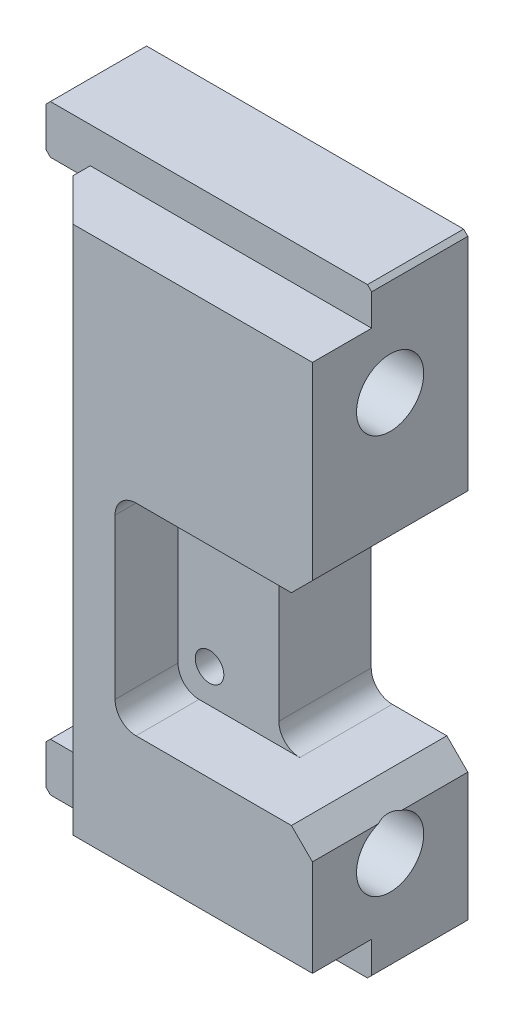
ISO-10303-21;
HEADER;
FILE_DESCRIPTION(('STEP AP214'),'2;1');
FILE_NAME('part.step','',(''),(''),'','','');
FILE_SCHEMA(('AUTOMOTIVE_DESIGN { 1 0 10303 214 1 1 1 1 }'));
ENDSEC;
DATA;
#1=APPLICATION_CONTEXT('core data for automotive mechanical design processes');
#2=APPLICATION_PROTOCOL_DEFINITION('international standard','automotive_design',2000,#1);
#3=PRODUCT_CONTEXT('',#1,'mechanical');
#4=PRODUCT('Part','Part','',(#3));
#5=PRODUCT_RELATED_PRODUCT_CATEGORY('part','',(#4));
#6=PRODUCT_DEFINITION_FORMATION('','',#4);
#7=PRODUCT_DEFINITION_CONTEXT('part definition',#1,'design');
#8=PRODUCT_DEFINITION('design','',#6,#7);
#9=PRODUCT_DEFINITION_SHAPE('','',#8);
#10=(LENGTH_UNIT() NAMED_UNIT(*) SI_UNIT(.MILLI.,.METRE.));
#11=(NAMED_UNIT(*) PLANE_ANGLE_UNIT() SI_UNIT($,.RADIAN.));
#12=(NAMED_UNIT(*) SI_UNIT($,.STERADIAN.) SOLID_ANGLE_UNIT());
#13=UNCERTAINTY_MEASURE_WITH_UNIT(LENGTH_MEASURE(1.E-05),#10,'distance_accuracy_value','');
#14=(GEOMETRIC_REPRESENTATION_CONTEXT(3) GLOBAL_UNCERTAINTY_ASSIGNED_CONTEXT((#13)) GLOBAL_UNIT_ASSIGNED_CONTEXT((#10,
#11,#12)) REPRESENTATION_CONTEXT('',''));
#15=CARTESIAN_POINT('',(0.,0.,0.));
#16=DIRECTION('',(0.,0.,1.));
#17=DIRECTION('',(1.,0.,0.));
#18=AXIS2_PLACEMENT_3D('',#15,#16,#17);
#19=CARTESIAN_POINT('',(-247.7866310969,306.3740503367,37.));
#20=DIRECTION('',(-1.,0.,0.));
#21=DIRECTION('',(0.,0.,1.));
#22=AXIS2_PLACEMENT_3D('',#19,#20,#21);
#23=PLANE('',#22);
#24=CARTESIAN_POINT('',(-247.7866310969,283.3740503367,18.5));
#25=DIRECTION('',(1.,0.,0.));
#26=DIRECTION('',(0.,0.,-1.));
#27=AXIS2_PLACEMENT_3D('',#24,#25,#26);
#28=CIRCLE('',#27,8.);
#29=CARTESIAN_POINT('',(-247.7866310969,283.3740503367,10.5));
#30=VERTEX_POINT('',#29);
#31=EDGE_CURVE('E494',#30,#30,#28,.T.);
#32=ORIENTED_EDGE('',*,*,#31,.F.);
#33=EDGE_LOOP('',(#32));
#34=FACE_BOUND('',#33,.T.);
#35=DIRECTION('',(0.,1.,0.));
#36=VECTOR('',#35,1.);
#37=CARTESIAN_POINT('',(-247.7866310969,298.8740503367,22.9));
#38=LINE('',#37,#36);
#39=CARTESIAN_POINT('',(-247.7866310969,298.8740503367,22.9));
#40=VERTEX_POINT('',#39);
#41=CARTESIAN_POINT('',(-247.7866310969,306.3740503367,22.9));
#42=VERTEX_POINT('',#41);
#43=EDGE_CURVE('E294',#40,#42,#38,.T.);
#44=ORIENTED_EDGE('',*,*,#43,.F.);
#45=DIRECTION('',(0.,0.,1.));
#46=VECTOR('',#45,1.);
#47=CARTESIAN_POINT('',(-247.7866310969,298.8740503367,22.9));
#48=LINE('',#47,#46);
#49=CARTESIAN_POINT('',(-247.7866310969,298.8740503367,37.));
#50=VERTEX_POINT('',#49);
#51=EDGE_CURVE('E298',#40,#50,#48,.T.);
#52=ORIENTED_EDGE('',*,*,#51,.T.);
#53=DIRECTION('',(0.,1.,0.));
#54=VECTOR('',#53,1.);
#55=CARTESIAN_POINT('',(-247.7866310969,306.3740503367,37.));
#56=LINE('',#55,#54);
#57=CARTESIAN_POINT('',(-247.7866310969,253.8740503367,37.));
#58=VERTEX_POINT('',#57);
#59=EDGE_CURVE('E368',#58,#50,#56,.T.);
#60=ORIENTED_EDGE('',*,*,#59,.F.);
#61=DIRECTION('',(0.,0.,-1.));
#62=VECTOR('',#61,1.);
#63=CARTESIAN_POINT('',(-247.7866310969,253.8740503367,37.));
#64=LINE('',#63,#62);
#65=CARTESIAN_POINT('',(-247.7866310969,253.8740503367,0.));
#66=VERTEX_POINT('',#65);
#67=EDGE_CURVE('E443',#58,#66,#64,.T.);
#68=ORIENTED_EDGE('',*,*,#67,.T.);
#69=DIRECTION('',(0.,1.,0.));
#70=VECTOR('',#69,1.);
#71=CARTESIAN_POINT('',(-247.7866310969,306.3740503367,0.));
#72=LINE('',#71,#70);
#73=CARTESIAN_POINT('',(-247.7866310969,306.3740503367,0.));
#74=VERTEX_POINT('',#73);
#75=EDGE_CURVE('E415',#66,#74,#72,.T.);
#76=ORIENTED_EDGE('',*,*,#75,.T.);
#77=DIRECTION('',(0.,0.,-1.));
#78=VECTOR('',#77,1.);
#79=CARTESIAN_POINT('',(-247.7866310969,306.3740503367,37.));
#80=LINE('',#79,#78);
#81=EDGE_CURVE('E441',#42,#74,#80,.T.);
#82=ORIENTED_EDGE('',*,*,#81,.F.);
#83=EDGE_LOOP('',(#44,#52,#60,#68,#76,#82));
#84=FACE_BOUND('',#83,.T.);
#85=ADVANCED_FACE('F37',(#34,#84),#23,.F.);
#86=CARTESIAN_POINT('',(-248.7866310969,307.3740503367,37.));
#87=DIRECTION('',(-0.707106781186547,-0.707106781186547,0.));
#88=DIRECTION('',(0.707106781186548,-0.707106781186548,0.));
#89=AXIS2_PLACEMENT_3D('',#86,#87,#88);
#90=PLANE('',#89);
#91=DIRECTION('',(-0.707106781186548,0.707106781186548,0.));
#92=VECTOR('',#91,1.);
#93=CARTESIAN_POINT('',(-248.7866310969,307.3740503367,22.9));
#94=LINE('',#93,#92);
#95=CARTESIAN_POINT('',(-248.7866310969,307.3740503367,22.9));
#96=VERTEX_POINT('',#95);
#97=EDGE_CURVE('E305',#42,#96,#94,.T.);
#98=ORIENTED_EDGE('',*,*,#97,.F.);
#99=ORIENTED_EDGE('',*,*,#81,.T.);
#100=DIRECTION('',(-0.707106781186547,0.707106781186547,0.));
#101=VECTOR('',#100,1.);
#102=CARTESIAN_POINT('',(-248.7866310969,307.3740503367,0.));
#103=LINE('',#102,#101);
#104=CARTESIAN_POINT('',(-248.7866310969,307.3740503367,0.));
#105=VERTEX_POINT('',#104);
#106=EDGE_CURVE('E418',#74,#105,#103,.T.);
#107=ORIENTED_EDGE('',*,*,#106,.T.);
#108=DIRECTION('',(0.,0.,-1.));
#109=VECTOR('',#108,1.);
#110=CARTESIAN_POINT('',(-248.7866310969,307.3740503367,37.));
#111=LINE('',#110,#109);
#112=EDGE_CURVE('E439',#96,#105,#111,.T.);
#113=ORIENTED_EDGE('',*,*,#112,.F.);
#114=EDGE_LOOP('',(#98,#99,#107,#113));
#115=FACE_BOUND('',#114,.T.);
#116=ADVANCED_FACE('F538',(#115),#90,.F.);
#117=CARTESIAN_POINT('',(-324.2866310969,307.3740503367,37.));
#118=DIRECTION('',(0.,-1.,0.));
#119=DIRECTION('',(0.,0.,-1.));
#120=AXIS2_PLACEMENT_3D('',#117,#118,#119);
#121=PLANE('',#120);
#122=DIRECTION('',(-1.,0.,0.));
#123=VECTOR('',#122,1.);
#124=CARTESIAN_POINT('',(-324.2866310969,307.3740503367,22.9));
#125=LINE('',#124,#123);
#126=CARTESIAN_POINT('',(-324.2866310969,307.3740503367,22.9));
#127=VERTEX_POINT('',#126);
#128=EDGE_CURVE('E303',#96,#127,#125,.T.);
#129=ORIENTED_EDGE('',*,*,#128,.F.);
#130=ORIENTED_EDGE('',*,*,#112,.T.);
#131=DIRECTION('',(-1.,0.,0.));
#132=VECTOR('',#131,1.);
#133=CARTESIAN_POINT('',(-324.2866310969,307.3740503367,0.));
#134=LINE('',#133,#132);
#135=CARTESIAN_POINT('',(-324.2866310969,307.3740503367,0.));
#136=VERTEX_POINT('',#135);
#137=EDGE_CURVE('E421',#105,#136,#134,.T.);
#138=ORIENTED_EDGE('',*,*,#137,.T.);
#139=DIRECTION('',(0.,0.,-1.));
#140=VECTOR('',#139,1.);
#141=CARTESIAN_POINT('',(-324.2866310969,307.3740503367,37.));
#142=LINE('',#141,#140);
#143=EDGE_CURVE('E437',#127,#136,#142,.T.);
#144=ORIENTED_EDGE('',*,*,#143,.F.);
#145=EDGE_LOOP('',(#129,#130,#138,#144));
#146=FACE_BOUND('',#145,.T.);
#147=ADVANCED_FACE('F544',(#146),#121,.F.);
#148=CARTESIAN_POINT('',(-325.2866310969,306.3740503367,37.));
#149=DIRECTION('',(0.707106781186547,-0.707106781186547,0.));
#150=DIRECTION('',(0.707106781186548,0.707106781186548,0.));
#151=AXIS2_PLACEMENT_3D('',#148,#149,#150);
#152=PLANE('',#151);
#153=DIRECTION('',(-0.707106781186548,-0.707106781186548,0.));
#154=VECTOR('',#153,1.);
#155=CARTESIAN_POINT('',(-325.2866310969,306.3740503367,22.9));
#156=LINE('',#155,#154);
#157=CARTESIAN_POINT('',(-325.2866310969,306.3740503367,22.9));
#158=VERTEX_POINT('',#157);
#159=EDGE_CURVE('E301',#127,#158,#156,.T.);
#160=ORIENTED_EDGE('',*,*,#159,.F.);
#161=ORIENTED_EDGE('',*,*,#143,.T.);
#162=DIRECTION('',(-0.707106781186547,-0.707106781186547,0.));
#163=VECTOR('',#162,1.);
#164=CARTESIAN_POINT('',(-325.2866310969,306.3740503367,0.));
#165=LINE('',#164,#163);
#166=CARTESIAN_POINT('',(-325.2866310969,306.3740503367,0.));
#167=VERTEX_POINT('',#166);
#168=EDGE_CURVE('E424',#136,#167,#165,.T.);
#169=ORIENTED_EDGE('',*,*,#168,.T.);
#170=DIRECTION('',(0.,0.,-1.));
#171=VECTOR('',#170,1.);
#172=CARTESIAN_POINT('',(-325.2866310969,306.3740503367,37.));
#173=LINE('',#172,#171);
#174=EDGE_CURVE('E435',#158,#167,#173,.T.);
#175=ORIENTED_EDGE('',*,*,#174,.F.);
#176=EDGE_LOOP('',(#160,#161,#169,#175));
#177=FACE_BOUND('',#176,.T.);
#178=ADVANCED_FACE('F573',(#177),#152,.F.);
#179=CARTESIAN_POINT('',(-265.7866310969,205.8740503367,37.));
#180=DIRECTION('',(0.,0.,-1.));
#181=DIRECTION('',(-1.,0.,0.));
#182=AXIS2_PLACEMENT_3D('',#179,#180,#181);
#183=CYLINDRICAL_SURFACE('',#182,4.99999999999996);
#184=CARTESIAN_POINT('',(-265.7866310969,205.8740503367,22.));
#185=DIRECTION('',(0.,0.,1.));
#186=DIRECTION('',(1.,0.,0.));
#187=AXIS2_PLACEMENT_3D('',#184,#185,#186);
#188=CIRCLE('',#187,4.99999999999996);
#189=CARTESIAN_POINT('',(-265.7866310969,200.8740503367,22.));
#190=VERTEX_POINT('',#189);
#191=CARTESIAN_POINT('',(-270.7866310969,205.8740503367,22.));
#192=VERTEX_POINT('',#191);
#193=EDGE_CURVE('E354',#190,#192,#188,.F.);
#194=ORIENTED_EDGE('',*,*,#193,.F.);
#195=DIRECTION('',(0.,0.,-1.));
#196=VECTOR('',#195,1.);
#197=CARTESIAN_POINT('',(-265.7866310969,200.8740503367,37.));
#198=LINE('',#197,#196);
#199=CARTESIAN_POINT('',(-265.7866310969,200.8740503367,0.));
#200=VERTEX_POINT('',#199);
#201=EDGE_CURVE('E455',#190,#200,#198,.T.);
#202=ORIENTED_EDGE('',*,*,#201,.T.);
#203=CARTESIAN_POINT('',(-265.7866310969,205.8740503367,0.));
#204=DIRECTION('',(0.,0.,-1.));
#205=DIRECTION('',(-1.,0.,0.));
#206=AXIS2_PLACEMENT_3D('',#203,#204,#205);
#207=CIRCLE('',#206,4.99999999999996);
#208=CARTESIAN_POINT('',(-270.7866310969,205.8740503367,0.));
#209=VERTEX_POINT('',#208);
#210=EDGE_CURVE('E402',#200,#209,#207,.T.);
#211=ORIENTED_EDGE('',*,*,#210,.T.);
#212=DIRECTION('',(0.,0.,-1.));
#213=VECTOR('',#212,1.);
#214=CARTESIAN_POINT('',(-270.7866310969,205.8740503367,37.));
#215=LINE('',#214,#213);
#216=EDGE_CURVE('E453',#192,#209,#215,.T.);
#217=ORIENTED_EDGE('',*,*,#216,.F.);
#218=EDGE_LOOP('',(#194,#202,#211,#217));
#219=FACE_BOUND('',#218,.T.);
#220=ADVANCED_FACE('F569',(#219),#183,.F.);
#221=CARTESIAN_POINT('',(-270.7866310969,243.8740503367,37.));
#222=DIRECTION('',(-1.,0.,0.));
#223=DIRECTION('',(0.,0.,1.));
#224=AXIS2_PLACEMENT_3D('',#221,#222,#223);
#225=PLANE('',#224);
#226=DIRECTION('',(0.,1.,0.));
#227=VECTOR('',#226,1.);
#228=CARTESIAN_POINT('',(-270.7866310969,243.8740503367,22.));
#229=LINE('',#228,#227);
#230=CARTESIAN_POINT('',(-270.7866310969,243.8740503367,22.));
#231=VERTEX_POINT('',#230);
#232=EDGE_CURVE('E346',#192,#231,#229,.T.);
#233=ORIENTED_EDGE('',*,*,#232,.F.);
#234=ORIENTED_EDGE('',*,*,#216,.T.);
#235=DIRECTION('',(0.,1.,0.));
#236=VECTOR('',#235,1.);
#237=CARTESIAN_POINT('',(-270.7866310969,243.8740503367,0.));
#238=LINE('',#237,#236);
#239=CARTESIAN_POINT('',(-270.7866310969,243.8740503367,0.));
#240=VERTEX_POINT('',#239);
#241=EDGE_CURVE('E405',#209,#240,#238,.T.);
#242=ORIENTED_EDGE('',*,*,#241,.T.);
#243=DIRECTION('',(0.,0.,-1.));
#244=VECTOR('',#243,1.);
#245=CARTESIAN_POINT('',(-270.7866310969,243.8740503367,37.));
#246=LINE('',#245,#244);
#247=EDGE_CURVE('E451',#231,#240,#246,.T.);
#248=ORIENTED_EDGE('',*,*,#247,.F.);
#249=EDGE_LOOP('',(#233,#234,#242,#248));
#250=FACE_BOUND('',#249,.T.);
#251=ADVANCED_FACE('F565',(#250),#225,.F.);
#252=CARTESIAN_POINT('',(-265.7866310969,243.8740503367,37.));
#253=DIRECTION('',(0.,0.,-1.));
#254=DIRECTION('',(-1.,0.,0.));
#255=AXIS2_PLACEMENT_3D('',#252,#253,#254);
#256=CYLINDRICAL_SURFACE('',#255,4.99999999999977);
#257=CARTESIAN_POINT('',(-265.7866310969,243.8740503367,22.));
#258=DIRECTION('',(0.,0.,1.));
#259=DIRECTION('',(1.,0.,0.));
#260=AXIS2_PLACEMENT_3D('',#257,#258,#259);
#261=CIRCLE('',#260,4.99999999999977);
#262=CARTESIAN_POINT('',(-265.7866310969,248.8740503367,22.));
#263=VERTEX_POINT('',#262);
#264=EDGE_CURVE('E479',#231,#263,#261,.F.);
#265=ORIENTED_EDGE('',*,*,#264,.F.);
#266=ORIENTED_EDGE('',*,*,#247,.T.);
#267=CARTESIAN_POINT('',(-265.7866310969,243.8740503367,0.));
#268=DIRECTION('',(0.,0.,-1.));
#269=DIRECTION('',(1.,0.,0.));
#270=AXIS2_PLACEMENT_3D('',#267,#268,#269);
#271=CIRCLE('',#270,4.99999999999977);
#272=CARTESIAN_POINT('',(-265.7866310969,248.8740503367,0.));
#273=VERTEX_POINT('',#272);
#274=EDGE_CURVE('E408',#240,#273,#271,.T.);
#275=ORIENTED_EDGE('',*,*,#274,.T.);
#276=DIRECTION('',(0.,0.,-1.));
#277=VECTOR('',#276,1.);
#278=CARTESIAN_POINT('',(-265.7866310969,248.8740503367,37.));
#279=LINE('',#278,#277);
#280=EDGE_CURVE('E449',#263,#273,#279,.T.);
#281=ORIENTED_EDGE('',*,*,#280,.F.);
#282=EDGE_LOOP('',(#265,#266,#275,#281));
#283=FACE_BOUND('',#282,.T.);
#284=ADVANCED_FACE('F561',(#283),#256,.F.);
#285=CARTESIAN_POINT('',(-314.7866310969,295.8740503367,37.));
#286=DIRECTION('',(0.,1.,0.));
#287=DIRECTION('',(0.,0.,1.));
#288=AXIS2_PLACEMENT_3D('',#285,#286,#287);
#289=PLANE('',#288);
#290=DIRECTION('',(0.,0.,-1.));
#291=VECTOR('',#290,1.);
#292=CARTESIAN_POINT('',(-314.7866310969,295.8740503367,37.));
#293=LINE('',#292,#291);
#294=CARTESIAN_POINT('',(-314.7866310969,295.8740503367,22.9));
#295=VERTEX_POINT('',#294);
#296=CARTESIAN_POINT('',(-314.7866310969,295.8740503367,0.));
#297=VERTEX_POINT('',#296);
#298=EDGE_CURVE('E477',#295,#297,#293,.T.);
#299=ORIENTED_EDGE('',*,*,#298,.F.);
#300=DIRECTION('',(-1.,0.,0.));
#301=VECTOR('',#300,1.);
#302=CARTESIAN_POINT('',(-314.7866310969,295.8740503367,22.9));
#303=LINE('',#302,#301);
#304=CARTESIAN_POINT('',(-324.2866310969,295.8740503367,22.9));
#305=VERTEX_POINT('',#304);
#306=EDGE_CURVE('E617',#295,#305,#303,.T.);
#307=ORIENTED_EDGE('',*,*,#306,.T.);
#308=DIRECTION('',(0.,0.,-1.));
#309=VECTOR('',#308,1.);
#310=CARTESIAN_POINT('',(-324.2866310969,295.8740503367,37.));
#311=LINE('',#310,#309);
#312=CARTESIAN_POINT('',(-324.2866310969,295.8740503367,0.));
#313=VERTEX_POINT('',#312);
#314=EDGE_CURVE('E371',#305,#313,#311,.T.);
#315=ORIENTED_EDGE('',*,*,#314,.T.);
#316=DIRECTION('',(1.,0.,0.));
#317=VECTOR('',#316,1.);
#318=CARTESIAN_POINT('',(-314.7866310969,295.8740503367,0.));
#319=LINE('',#318,#317);
#320=EDGE_CURVE('E356',#313,#297,#319,.T.);
#321=ORIENTED_EDGE('',*,*,#320,.T.);
#322=EDGE_LOOP('',(#299,#307,#315,#321));
#323=FACE_BOUND('',#322,.T.);
#324=ADVANCED_FACE('F564',(#323),#289,.F.);
#325=CARTESIAN_POINT('',(-314.7866310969,295.8740503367,37.));
#326=DIRECTION('',(1.,0.,0.));
#327=DIRECTION('',(0.,0.,-1.));
#328=AXIS2_PLACEMENT_3D('',#325,#326,#327);
#329=PLANE('',#328);
#330=DIRECTION('',(0.,0.,-1.));
#331=VECTOR('',#330,1.);
#332=CARTESIAN_POINT('',(-314.7866310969,175.8740503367,37.));
#333=LINE('',#332,#331);
#334=CARTESIAN_POINT('',(-314.7866310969,175.8740503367,22.9));
#335=VERTEX_POINT('',#334);
#336=CARTESIAN_POINT('',(-314.7866310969,175.8740503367,0.));
#337=VERTEX_POINT('',#336);
#338=EDGE_CURVE('E257',#335,#337,#333,.T.);
#339=ORIENTED_EDGE('',*,*,#338,.F.);
#340=DIRECTION('',(0.,-1.,0.));
#341=VECTOR('',#340,1.);
#342=CARTESIAN_POINT('',(-314.7866310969,307.3740503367,22.9));
#343=LINE('',#342,#341);
#344=CARTESIAN_POINT('',(-314.7866310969,172.8740503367,22.9));
#345=VERTEX_POINT('',#344);
#346=EDGE_CURVE('E251',#335,#345,#343,.T.);
#347=ORIENTED_EDGE('',*,*,#346,.T.);
#348=DIRECTION('',(0.,0.,1.));
#349=VECTOR('',#348,1.);
#350=CARTESIAN_POINT('',(-314.7866310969,172.8740503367,26.9999999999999));
#351=LINE('',#350,#349);
#352=CARTESIAN_POINT('',(-314.7866310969,172.8740503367,26.9999999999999));
#353=VERTEX_POINT('',#352);
#354=EDGE_CURVE('E254',#345,#353,#351,.T.);
#355=ORIENTED_EDGE('',*,*,#354,.T.);
#356=DIRECTION('',(0.,1.,0.));
#357=VECTOR('',#356,1.);
#358=CARTESIAN_POINT('',(-314.7866310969,295.8740503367,26.9999999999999));
#359=LINE('',#358,#357);
#360=CARTESIAN_POINT('',(-314.7866310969,298.8740503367,26.9999999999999));
#361=VERTEX_POINT('',#360);
#362=EDGE_CURVE('E483',#353,#361,#359,.T.);
#363=ORIENTED_EDGE('',*,*,#362,.T.);
#364=DIRECTION('',(0.,0.,1.));
#365=VECTOR('',#364,1.);
#366=CARTESIAN_POINT('',(-314.7866310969,298.8740503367,22.9));
#367=LINE('',#366,#365);
#368=CARTESIAN_POINT('',(-314.7866310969,298.8740503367,22.9));
#369=VERTEX_POINT('',#368);
#370=EDGE_CURVE('E631',#369,#361,#367,.T.);
#371=ORIENTED_EDGE('',*,*,#370,.F.);
#372=EDGE_CURVE('E52',#369,#295,#343,.T.);
#373=ORIENTED_EDGE('',*,*,#372,.T.);
#374=ORIENTED_EDGE('',*,*,#298,.T.);
#375=DIRECTION('',(0.,-1.,0.));
#376=VECTOR('',#375,1.);
#377=CARTESIAN_POINT('',(-314.7866310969,295.8740503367,0.));
#378=LINE('',#377,#376);
#379=EDGE_CURVE('E374',#297,#337,#378,.T.);
#380=ORIENTED_EDGE('',*,*,#379,.T.);
#381=EDGE_LOOP('',(#339,#347,#355,#363,#371,#373,#374,#380));
#382=FACE_BOUND('',#381,.T.);
#383=ADVANCED_FACE('F253',(#382),#329,.F.);
#384=CARTESIAN_POINT('',(-324.2866310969,175.8740503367,37.));
#385=DIRECTION('',(0.,-1.,0.));
#386=DIRECTION('',(0.,0.,-1.));
#387=AXIS2_PLACEMENT_3D('',#384,#385,#386);
#388=PLANE('',#387);
#389=DIRECTION('',(0.,0.,-1.));
#390=VECTOR('',#389,1.);
#391=CARTESIAN_POINT('',(-324.2866310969,175.8740503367,37.));
#392=LINE('',#391,#390);
#393=CARTESIAN_POINT('',(-324.2866310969,175.8740503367,22.9));
#394=VERTEX_POINT('',#393);
#395=CARTESIAN_POINT('',(-324.2866310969,175.8740503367,0.));
#396=VERTEX_POINT('',#395);
#397=EDGE_CURVE('E474',#394,#396,#392,.T.);
#398=ORIENTED_EDGE('',*,*,#397,.F.);
#399=DIRECTION('',(1.,0.,0.));
#400=VECTOR('',#399,1.);
#401=CARTESIAN_POINT('',(-324.2866310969,175.8740503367,22.9));
#402=LINE('',#401,#400);
#403=EDGE_CURVE('E628',#394,#335,#402,.T.);
#404=ORIENTED_EDGE('',*,*,#403,.T.);
#405=ORIENTED_EDGE('',*,*,#338,.T.);
#406=DIRECTION('',(-1.,0.,0.));
#407=VECTOR('',#406,1.);
#408=CARTESIAN_POINT('',(-324.2866310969,175.8740503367,0.));
#409=LINE('',#408,#407);
#410=EDGE_CURVE('E376',#337,#396,#409,.T.);
#411=ORIENTED_EDGE('',*,*,#410,.T.);
#412=EDGE_LOOP('',(#398,#404,#405,#411));
#413=FACE_BOUND('',#412,.T.);
#414=ADVANCED_FACE('F605',(#413),#388,.F.);
#415=CARTESIAN_POINT('',(-324.2866310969,175.8740503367,37.));
#416=DIRECTION('',(0.707106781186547,-0.707106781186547,0.));
#417=DIRECTION('',(0.707106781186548,0.707106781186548,0.));
#418=AXIS2_PLACEMENT_3D('',#415,#416,#417);
#419=PLANE('',#418);
#420=DIRECTION('',(0.,0.,-1.));
#421=VECTOR('',#420,1.);
#422=CARTESIAN_POINT('',(-325.2866310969,174.8740503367,37.));
#423=LINE('',#422,#421);
#424=CARTESIAN_POINT('',(-325.2866310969,174.8740503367,22.9));
#425=VERTEX_POINT('',#424);
#426=CARTESIAN_POINT('',(-325.2866310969,174.8740503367,0.));
#427=VERTEX_POINT('',#426);
#428=EDGE_CURVE('E472',#425,#427,#423,.T.);
#429=ORIENTED_EDGE('',*,*,#428,.F.);
#430=DIRECTION('',(0.707106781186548,0.707106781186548,0.));
#431=VECTOR('',#430,1.);
#432=CARTESIAN_POINT('',(-324.2866310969,175.8740503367,22.9));
#433=LINE('',#432,#431);
#434=EDGE_CURVE('E632',#425,#394,#433,.T.);
#435=ORIENTED_EDGE('',*,*,#434,.T.);
#436=ORIENTED_EDGE('',*,*,#397,.T.);
#437=DIRECTION('',(-0.707106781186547,-0.707106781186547,0.));
#438=VECTOR('',#437,1.);
#439=CARTESIAN_POINT('',(-324.2866310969,175.8740503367,0.));
#440=LINE('',#439,#438);
#441=EDGE_CURVE('E379',#396,#427,#440,.T.);
#442=ORIENTED_EDGE('',*,*,#441,.T.);
#443=EDGE_LOOP('',(#429,#435,#436,#442));
#444=FACE_BOUND('',#443,.T.);
#445=ADVANCED_FACE('F601',(#444),#419,.F.);
#446=CARTESIAN_POINT('',(-325.2866310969,174.8740503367,37.));
#447=DIRECTION('',(1.,0.,0.));
#448=DIRECTION('',(0.,0.,-1.));
#449=AXIS2_PLACEMENT_3D('',#446,#447,#448);
#450=PLANE('',#449);
#451=DIRECTION('',(0.,1.,0.));
#452=VECTOR('',#451,1.);
#453=CARTESIAN_POINT('',(-325.2866310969,174.8740503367,22.9));
#454=LINE('',#453,#452);
#455=CARTESIAN_POINT('',(-325.2866310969,165.3740503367,22.9));
#456=VERTEX_POINT('',#455);
#457=EDGE_CURVE('E292',#456,#425,#454,.T.);
#458=ORIENTED_EDGE('',*,*,#457,.T.);
#459=ORIENTED_EDGE('',*,*,#428,.T.);
#460=DIRECTION('',(0.,-1.,0.));
#461=VECTOR('',#460,1.);
#462=CARTESIAN_POINT('',(-325.2866310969,174.8740503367,0.));
#463=LINE('',#462,#461);
#464=CARTESIAN_POINT('',(-325.2866310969,165.3740503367,0.));
#465=VERTEX_POINT('',#464);
#466=EDGE_CURVE('E382',#427,#465,#463,.T.);
#467=ORIENTED_EDGE('',*,*,#466,.T.);
#468=DIRECTION('',(0.,0.,-1.));
#469=VECTOR('',#468,1.);
#470=CARTESIAN_POINT('',(-325.2866310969,165.3740503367,37.));
#471=LINE('',#470,#469);
#472=EDGE_CURVE('E470',#456,#465,#471,.T.);
#473=ORIENTED_EDGE('',*,*,#472,.F.);
#474=EDGE_LOOP('',(#458,#459,#467,#473));
#475=FACE_BOUND('',#474,.T.);
#476=ADVANCED_FACE('F597',(#475),#450,.F.);
#477=CARTESIAN_POINT('',(-325.2866310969,165.3740503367,37.));
#478=DIRECTION('',(0.707106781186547,0.707106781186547,0.));
#479=DIRECTION('',(-0.707106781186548,0.707106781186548,0.));
#480=AXIS2_PLACEMENT_3D('',#477,#478,#479);
#481=PLANE('',#480);
#482=DIRECTION('',(0.,0.,-1.));
#483=VECTOR('',#482,1.);
#484=CARTESIAN_POINT('',(-324.2866310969,164.3740503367,37.));
#485=LINE('',#484,#483);
#486=CARTESIAN_POINT('',(-324.2866310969,164.3740503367,22.9));
#487=VERTEX_POINT('',#486);
#488=CARTESIAN_POINT('',(-324.2866310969,164.3740503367,0.));
#489=VERTEX_POINT('',#488);
#490=EDGE_CURVE('E468',#487,#489,#485,.T.);
#491=ORIENTED_EDGE('',*,*,#490,.F.);
#492=DIRECTION('',(-0.707106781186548,0.707106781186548,0.));
#493=VECTOR('',#492,1.);
#494=CARTESIAN_POINT('',(-325.2866310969,165.3740503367,22.9));
#495=LINE('',#494,#493);
#496=EDGE_CURVE('E289',#487,#456,#495,.T.);
#497=ORIENTED_EDGE('',*,*,#496,.T.);
#498=ORIENTED_EDGE('',*,*,#472,.T.);
#499=DIRECTION('',(0.707106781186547,-0.707106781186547,0.));
#500=VECTOR('',#499,1.);
#501=CARTESIAN_POINT('',(-325.2866310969,165.3740503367,0.));
#502=LINE('',#501,#500);
#503=EDGE_CURVE('E385',#465,#489,#502,.T.);
#504=ORIENTED_EDGE('',*,*,#503,.T.);
#505=EDGE_LOOP('',(#491,#497,#498,#504));
#506=FACE_BOUND('',#505,.T.);
#507=ADVANCED_FACE('F593',(#506),#481,.F.);
#508=CARTESIAN_POINT('',(-324.2866310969,164.3740503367,37.));
#509=DIRECTION('',(0.,1.,0.));
#510=DIRECTION('',(0.,0.,1.));
#511=AXIS2_PLACEMENT_3D('',#508,#509,#510);
#512=PLANE('',#511);
#513=DIRECTION('',(0.,0.,-1.));
#514=VECTOR('',#513,1.);
#515=CARTESIAN_POINT('',(-248.7866310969,164.3740503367,37.));
#516=LINE('',#515,#514);
#517=CARTESIAN_POINT('',(-248.7866310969,164.3740503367,22.9));
#518=VERTEX_POINT('',#517);
#519=CARTESIAN_POINT('',(-248.7866310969,164.3740503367,0.));
#520=VERTEX_POINT('',#519);
#521=EDGE_CURVE('E466',#518,#520,#516,.T.);
#522=ORIENTED_EDGE('',*,*,#521,.F.);
#523=DIRECTION('',(-1.,0.,0.));
#524=VECTOR('',#523,1.);
#525=CARTESIAN_POINT('',(-324.2866310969,164.3740503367,22.9));
#526=LINE('',#525,#524);
#527=EDGE_CURVE('E286',#518,#487,#526,.T.);
#528=ORIENTED_EDGE('',*,*,#527,.T.);
#529=ORIENTED_EDGE('',*,*,#490,.T.);
#530=DIRECTION('',(1.,0.,0.));
#531=VECTOR('',#530,1.);
#532=CARTESIAN_POINT('',(-324.2866310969,164.3740503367,0.));
#533=LINE('',#532,#531);
#534=EDGE_CURVE('E388',#489,#520,#533,.T.);
#535=ORIENTED_EDGE('',*,*,#534,.T.);
#536=EDGE_LOOP('',(#522,#528,#529,#535));
#537=FACE_BOUND('',#536,.T.);
#538=ADVANCED_FACE('F589',(#537),#512,.F.);
#539=CARTESIAN_POINT('',(-248.7866310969,164.3740503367,37.));
#540=DIRECTION('',(-0.707106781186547,0.707106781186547,0.));
#541=DIRECTION('',(-0.707106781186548,-0.707106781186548,0.));
#542=AXIS2_PLACEMENT_3D('',#539,#540,#541);
#543=PLANE('',#542);
#544=DIRECTION('',(0.,0.,-1.));
#545=VECTOR('',#544,1.);
#546=CARTESIAN_POINT('',(-247.7866310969,165.3740503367,37.));
#547=LINE('',#546,#545);
#548=CARTESIAN_POINT('',(-247.7866310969,165.3740503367,22.9));
#549=VERTEX_POINT('',#548);
#550=CARTESIAN_POINT('',(-247.7866310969,165.3740503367,0.));
#551=VERTEX_POINT('',#550);
#552=EDGE_CURVE('E464',#549,#551,#547,.T.);
#553=ORIENTED_EDGE('',*,*,#552,.F.);
#554=DIRECTION('',(-0.707106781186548,-0.707106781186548,0.));
#555=VECTOR('',#554,1.);
#556=CARTESIAN_POINT('',(-248.7866310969,164.3740503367,22.9));
#557=LINE('',#556,#555);
#558=EDGE_CURVE('E276',#549,#518,#557,.T.);
#559=ORIENTED_EDGE('',*,*,#558,.T.);
#560=ORIENTED_EDGE('',*,*,#521,.T.);
#561=DIRECTION('',(0.707106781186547,0.707106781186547,0.));
#562=VECTOR('',#561,1.);
#563=CARTESIAN_POINT('',(-248.7866310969,164.3740503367,0.));
#564=LINE('',#563,#562);
#565=EDGE_CURVE('E391',#520,#551,#564,.T.);
#566=ORIENTED_EDGE('',*,*,#565,.T.);
#567=EDGE_LOOP('',(#553,#559,#560,#566));
#568=FACE_BOUND('',#567,.T.);
#569=ADVANCED_FACE('F585',(#568),#543,.F.);
#570=CARTESIAN_POINT('',(-247.7866310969,195.8740503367,37.));
#571=DIRECTION('',(-1.,0.,0.));
#572=DIRECTION('',(0.,0.,1.));
#573=AXIS2_PLACEMENT_3D('',#570,#571,#572);
#574=PLANE('',#573);
#575=DIRECTION('',(0.,0.,-1.));
#576=VECTOR('',#575,1.);
#577=CARTESIAN_POINT('',(-247.7866310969,195.8740503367,37.));
#578=LINE('',#577,#576);
#579=CARTESIAN_POINT('',(-247.7866310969,195.8740503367,15.7161178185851));
#580=VERTEX_POINT('',#579);
#581=CARTESIAN_POINT('',(-247.7866310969,195.8740503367,0.));
#582=VERTEX_POINT('',#581);
#583=EDGE_CURVE('E460',#580,#582,#578,.T.);
#584=ORIENTED_EDGE('',*,*,#583,.F.);
#585=CARTESIAN_POINT('',(-247.7866310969,188.3740503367,18.5));
#586=DIRECTION('',(1.,0.,0.));
#587=DIRECTION('',(0.,0.,-1.));
#588=AXIS2_PLACEMENT_3D('',#585,#586,#587);
#589=CIRCLE('',#588,8.);
#590=CARTESIAN_POINT('',(-247.7866310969,195.8740503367,21.2838821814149));
#591=VERTEX_POINT('',#590);
#592=EDGE_CURVE('E59',#591,#580,#589,.T.);
#593=ORIENTED_EDGE('',*,*,#592,.F.);
#594=CARTESIAN_POINT('',(-247.7866310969,195.8740503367,37.));
#595=VERTEX_POINT('',#594);
#596=EDGE_CURVE('E461',#595,#591,#578,.T.);
#597=ORIENTED_EDGE('',*,*,#596,.F.);
#598=DIRECTION('',(0.,1.,0.));
#599=VECTOR('',#598,1.);
#600=CARTESIAN_POINT('',(-247.7866310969,195.8740503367,37.));
#601=LINE('',#600,#599);
#602=CARTESIAN_POINT('',(-247.7866310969,172.8740503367,37.));
#603=VERTEX_POINT('',#602);
#604=EDGE_CURVE('E357',#603,#595,#601,.T.);
#605=ORIENTED_EDGE('',*,*,#604,.F.);
#606=DIRECTION('',(0.,0.,1.));
#607=VECTOR('',#606,1.);
#608=CARTESIAN_POINT('',(-247.7866310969,172.8740503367,22.9));
#609=LINE('',#608,#607);
#610=CARTESIAN_POINT('',(-247.7866310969,172.8740503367,22.9));
#611=VERTEX_POINT('',#610);
#612=EDGE_CURVE('E274',#611,#603,#609,.T.);
#613=ORIENTED_EDGE('',*,*,#612,.F.);
#614=DIRECTION('',(0.,1.,0.));
#615=VECTOR('',#614,1.);
#616=CARTESIAN_POINT('',(-247.7866310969,172.8740503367,22.9));
#617=LINE('',#616,#615);
#618=EDGE_CURVE('E273',#549,#611,#617,.T.);
#619=ORIENTED_EDGE('',*,*,#618,.F.);
#620=ORIENTED_EDGE('',*,*,#552,.T.);
#621=DIRECTION('',(0.,1.,0.));
#622=VECTOR('',#621,1.);
#623=CARTESIAN_POINT('',(-247.7866310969,195.8740503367,0.));
#624=LINE('',#623,#622);
#625=EDGE_CURVE('E394',#551,#582,#624,.T.);
#626=ORIENTED_EDGE('',*,*,#625,.T.);
#627=EDGE_LOOP('',(#584,#593,#597,#605,#613,#619,#620,#626));
#628=FACE_BOUND('',#627,.T.);
#629=ADVANCED_FACE('F581',(#628),#574,.F.);
#630=CARTESIAN_POINT('',(-252.7866310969,200.8740503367,37.));
#631=DIRECTION('',(-0.707106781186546,-0.707106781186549,0.));
#632=DIRECTION('',(0.707106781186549,-0.707106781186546,0.));
#633=AXIS2_PLACEMENT_3D('',#630,#631,#632);
#634=PLANE('',#633);
#635=ORIENTED_EDGE('',*,*,#596,.T.);
#636=CARTESIAN_POINT('',(-240.2866310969,188.3740503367,18.5));
#637=DIRECTION('',(-0.707106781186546,-0.707106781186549,0.));
#638=DIRECTION('',(0.707106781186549,-0.707106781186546,0.));
#639=AXIS2_PLACEMENT_3D('',#636,#637,#638);
#640=ELLIPSE('',#639,11.3137084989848,8.);
#641=EDGE_CURVE('E11',#591,#580,#640,.T.);
#642=ORIENTED_EDGE('',*,*,#641,.T.);
#643=ORIENTED_EDGE('',*,*,#583,.T.);
#644=DIRECTION('',(-0.707106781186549,0.707106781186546,0.));
#645=VECTOR('',#644,1.);
#646=CARTESIAN_POINT('',(-252.7866310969,200.8740503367,0.));
#647=LINE('',#646,#645);
#648=CARTESIAN_POINT('',(-252.7866310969,200.8740503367,0.));
#649=VERTEX_POINT('',#648);
#650=EDGE_CURVE('E397',#582,#649,#647,.T.);
#651=ORIENTED_EDGE('',*,*,#650,.T.);
#652=DIRECTION('',(0.,0.,-1.));
#653=VECTOR('',#652,1.);
#654=CARTESIAN_POINT('',(-252.7866310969,200.8740503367,37.));
#655=LINE('',#654,#653);
#656=CARTESIAN_POINT('',(-252.7866310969,200.8740503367,37.));
#657=VERTEX_POINT('',#656);
#658=EDGE_CURVE('E457',#657,#649,#655,.T.);
#659=ORIENTED_EDGE('',*,*,#658,.F.);
#660=DIRECTION('',(-0.707106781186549,0.707106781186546,0.));
#661=VECTOR('',#660,1.);
#662=CARTESIAN_POINT('',(-252.7866310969,200.8740503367,37.));
#663=LINE('',#662,#661);
#664=EDGE_CURVE('E359',#595,#657,#663,.T.);
#665=ORIENTED_EDGE('',*,*,#664,.F.);
#666=EDGE_LOOP('',(#635,#642,#643,#651,#659,#665));
#667=FACE_BOUND('',#666,.T.);
#668=ADVANCED_FACE('F577',(#667),#634,.F.);
#669=CARTESIAN_POINT('',(-265.7866310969,200.8740503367,37.));
#670=DIRECTION('',(0.,-1.,0.));
#671=DIRECTION('',(1.,0.,0.));
#672=AXIS2_PLACEMENT_3D('',#669,#670,#671);
#673=PLANE('',#672);
#674=DIRECTION('',(-1.,0.,0.));
#675=VECTOR('',#674,1.);
#676=CARTESIAN_POINT('',(-265.7866310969,200.8740503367,0.));
#677=LINE('',#676,#675);
#678=EDGE_CURVE('E399',#649,#200,#677,.T.);
#679=ORIENTED_EDGE('',*,*,#678,.T.);
#680=ORIENTED_EDGE('',*,*,#201,.F.);
#681=DIRECTION('',(1.,0.,0.));
#682=VECTOR('',#681,1.);
#683=CARTESIAN_POINT('',(-289.7866310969,200.8740503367,22.));
#684=LINE('',#683,#682);
#685=CARTESIAN_POINT('',(-289.7866310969,200.8740503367,22.));
#686=VERTEX_POINT('',#685);
#687=EDGE_CURVE('E333',#686,#190,#684,.T.);
#688=ORIENTED_EDGE('',*,*,#687,.F.);
#689=DIRECTION('',(0.,0.,1.));
#690=VECTOR('',#689,1.);
#691=CARTESIAN_POINT('',(-289.7866310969,200.8740503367,22.));
#692=LINE('',#691,#690);
#693=CARTESIAN_POINT('',(-289.7866310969,200.8740503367,37.));
#694=VERTEX_POINT('',#693);
#695=EDGE_CURVE('E343',#686,#694,#692,.T.);
#696=ORIENTED_EDGE('',*,*,#695,.T.);
#697=DIRECTION('',(-1.,0.,0.));
#698=VECTOR('',#697,1.);
#699=CARTESIAN_POINT('',(-265.7866310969,200.8740503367,37.));
#700=LINE('',#699,#698);
#701=EDGE_CURVE('E362',#657,#694,#700,.T.);
#702=ORIENTED_EDGE('',*,*,#701,.F.);
#703=ORIENTED_EDGE('',*,*,#658,.T.);
#704=EDGE_LOOP('',(#679,#680,#688,#696,#702,#703));
#705=FACE_BOUND('',#704,.T.);
#706=ADVANCED_FACE('F559',(#705),#673,.F.);
#707=CARTESIAN_POINT('',(-265.7866310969,248.8740503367,37.));
#708=DIRECTION('',(0.,1.,0.));
#709=DIRECTION('',(0.,0.,1.));
#710=AXIS2_PLACEMENT_3D('',#707,#708,#709);
#711=PLANE('',#710);
#712=DIRECTION('',(1.,0.,0.));
#713=VECTOR('',#712,1.);
#714=CARTESIAN_POINT('',(-265.7866310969,248.8740503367,0.));
#715=LINE('',#714,#713);
#716=CARTESIAN_POINT('',(-252.7866310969,248.8740503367,0.));
#717=VERTEX_POINT('',#716);
#718=EDGE_CURVE('E411',#273,#717,#715,.T.);
#719=ORIENTED_EDGE('',*,*,#718,.T.);
#720=DIRECTION('',(0.,0.,-1.));
#721=VECTOR('',#720,1.);
#722=CARTESIAN_POINT('',(-252.7866310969,248.8740503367,37.));
#723=LINE('',#722,#721);
#724=CARTESIAN_POINT('',(-252.7866310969,248.8740503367,37.));
#725=VERTEX_POINT('',#724);
#726=EDGE_CURVE('E446',#725,#717,#723,.T.);
#727=ORIENTED_EDGE('',*,*,#726,.F.);
#728=DIRECTION('',(1.,0.,0.));
#729=VECTOR('',#728,1.);
#730=CARTESIAN_POINT('',(-265.7866310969,248.8740503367,37.));
#731=LINE('',#730,#729);
#732=CARTESIAN_POINT('',(-289.7866310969,248.8740503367,37.));
#733=VERTEX_POINT('',#732);
#734=EDGE_CURVE('E364',#733,#725,#731,.T.);
#735=ORIENTED_EDGE('',*,*,#734,.F.);
#736=DIRECTION('',(0.,0.,1.));
#737=VECTOR('',#736,1.);
#738=CARTESIAN_POINT('',(-289.7866310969,248.8740503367,22.));
#739=LINE('',#738,#737);
#740=CARTESIAN_POINT('',(-289.7866310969,248.8740503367,22.));
#741=VERTEX_POINT('',#740);
#742=EDGE_CURVE('E335',#741,#733,#739,.T.);
#743=ORIENTED_EDGE('',*,*,#742,.F.);
#744=DIRECTION('',(-1.,0.,0.));
#745=VECTOR('',#744,1.);
#746=CARTESIAN_POINT('',(-265.7866310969,248.8740503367,22.));
#747=LINE('',#746,#745);
#748=EDGE_CURVE('E320',#263,#741,#747,.T.);
#749=ORIENTED_EDGE('',*,*,#748,.F.);
#750=ORIENTED_EDGE('',*,*,#280,.T.);
#751=EDGE_LOOP('',(#719,#727,#735,#743,#749,#750));
#752=FACE_BOUND('',#751,.T.);
#753=ADVANCED_FACE('F555',(#752),#711,.F.);
#754=CARTESIAN_POINT('',(-252.7866310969,248.8740503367,37.));
#755=DIRECTION('',(-0.707106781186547,0.707106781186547,0.));
#756=DIRECTION('',(-0.707106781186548,-0.707106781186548,0.));
#757=AXIS2_PLACEMENT_3D('',#754,#755,#756);
#758=PLANE('',#757);
#759=DIRECTION('',(0.707106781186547,0.707106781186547,0.));
#760=VECTOR('',#759,1.);
#761=CARTESIAN_POINT('',(-252.7866310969,248.8740503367,0.));
#762=LINE('',#761,#760);
#763=EDGE_CURVE('E413',#717,#66,#762,.T.);
#764=ORIENTED_EDGE('',*,*,#763,.T.);
#765=ORIENTED_EDGE('',*,*,#67,.F.);
#766=DIRECTION('',(0.707106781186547,0.707106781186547,0.));
#767=VECTOR('',#766,1.);
#768=CARTESIAN_POINT('',(-252.7866310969,248.8740503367,37.));
#769=LINE('',#768,#767);
#770=EDGE_CURVE('E366',#725,#58,#769,.T.);
#771=ORIENTED_EDGE('',*,*,#770,.F.);
#772=ORIENTED_EDGE('',*,*,#726,.T.);
#773=EDGE_LOOP('',(#764,#765,#771,#772));
#774=FACE_BOUND('',#773,.T.);
#775=ADVANCED_FACE('F551',(#774),#758,.F.);
#776=CARTESIAN_POINT('',(-325.2866310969,306.3740503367,37.));
#777=DIRECTION('',(1.,0.,0.));
#778=DIRECTION('',(0.,0.,-1.));
#779=AXIS2_PLACEMENT_3D('',#776,#777,#778);
#780=PLANE('',#779);
#781=DIRECTION('',(0.,0.,-1.));
#782=VECTOR('',#781,1.);
#783=CARTESIAN_POINT('',(-325.2866310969,296.8740503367,37.));
#784=LINE('',#783,#782);
#785=CARTESIAN_POINT('',(-325.2866310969,296.8740503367,22.9));
#786=VERTEX_POINT('',#785);
#787=CARTESIAN_POINT('',(-325.2866310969,296.8740503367,0.));
#788=VERTEX_POINT('',#787);
#789=EDGE_CURVE('E433',#786,#788,#784,.T.);
#790=ORIENTED_EDGE('',*,*,#789,.F.);
#791=DIRECTION('',(0.,-1.,0.));
#792=VECTOR('',#791,1.);
#793=CARTESIAN_POINT('',(-325.2866310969,306.3740503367,22.9));
#794=LINE('',#793,#792);
#795=EDGE_CURVE('E45',#158,#786,#794,.T.);
#796=ORIENTED_EDGE('',*,*,#795,.F.);
#797=ORIENTED_EDGE('',*,*,#174,.T.);
#798=DIRECTION('',(0.,-1.,0.));
#799=VECTOR('',#798,1.);
#800=CARTESIAN_POINT('',(-325.2866310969,306.3740503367,0.));
#801=LINE('',#800,#799);
#802=EDGE_CURVE('E427',#167,#788,#801,.T.);
#803=ORIENTED_EDGE('',*,*,#802,.T.);
#804=EDGE_LOOP('',(#790,#796,#797,#803));
#805=FACE_BOUND('',#804,.T.);
#806=ADVANCED_FACE('F554',(#805),#780,.F.);
#807=CARTESIAN_POINT('',(-324.2866310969,295.8740503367,37.));
#808=DIRECTION('',(0.707106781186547,0.707106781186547,0.));
#809=DIRECTION('',(-0.707106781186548,0.707106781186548,0.));
#810=AXIS2_PLACEMENT_3D('',#807,#808,#809);
#811=PLANE('',#810);
#812=ORIENTED_EDGE('',*,*,#314,.F.);
#813=DIRECTION('',(-0.707106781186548,0.707106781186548,0.));
#814=VECTOR('',#813,1.);
#815=CARTESIAN_POINT('',(-324.2866310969,295.8740503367,22.9));
#816=LINE('',#815,#814);
#817=EDGE_CURVE('E638',#305,#786,#816,.T.);
#818=ORIENTED_EDGE('',*,*,#817,.T.);
#819=ORIENTED_EDGE('',*,*,#789,.T.);
#820=DIRECTION('',(0.707106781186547,-0.707106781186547,0.));
#821=VECTOR('',#820,1.);
#822=CARTESIAN_POINT('',(-324.2866310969,295.8740503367,0.));
#823=LINE('',#822,#821);
#824=EDGE_CURVE('E360',#788,#313,#823,.T.);
#825=ORIENTED_EDGE('',*,*,#824,.T.);
#826=EDGE_LOOP('',(#812,#818,#819,#825));
#827=FACE_BOUND('',#826,.T.);
#828=ADVANCED_FACE('F700',(#827),#811,.F.);
#829=CARTESIAN_POINT('',(-265.7866310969,243.8740503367,37.));
#830=DIRECTION('',(0.,0.,1.));
#831=DIRECTION('',(1.,0.,0.));
#832=AXIS2_PLACEMENT_3D('',#829,#830,#831);
#833=PLANE('',#832);
#834=DIRECTION('',(0.,-1.,0.));
#835=VECTOR('',#834,1.);
#836=CARTESIAN_POINT('',(-304.7866310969,175.8740503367,37.));
#837=LINE('',#836,#835);
#838=CARTESIAN_POINT('',(-304.7866310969,298.8740503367,37.));
#839=VERTEX_POINT('',#838);
#840=CARTESIAN_POINT('',(-304.7866310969,172.8740503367,37.));
#841=VERTEX_POINT('',#840);
#842=EDGE_CURVE('E481',#839,#841,#837,.T.);
#843=ORIENTED_EDGE('',*,*,#842,.T.);
#844=DIRECTION('',(-1.,0.,0.));
#845=VECTOR('',#844,1.);
#846=CARTESIAN_POINT('',(-247.7866310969,172.8740503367,37.));
#847=LINE('',#846,#845);
#848=EDGE_CURVE('E278',#603,#841,#847,.T.);
#849=ORIENTED_EDGE('',*,*,#848,.F.);
#850=ORIENTED_EDGE('',*,*,#604,.T.);
#851=ORIENTED_EDGE('',*,*,#664,.T.);
#852=ORIENTED_EDGE('',*,*,#701,.T.);
#853=CARTESIAN_POINT('',(-289.7866310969,205.8740503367,37.));
#854=DIRECTION('',(0.,0.,1.));
#855=DIRECTION('',(1.,0.,0.));
#856=AXIS2_PLACEMENT_3D('',#853,#854,#855);
#857=CIRCLE('',#856,4.99999999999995);
#858=CARTESIAN_POINT('',(-294.7866310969,205.8740503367,37.));
#859=VERTEX_POINT('',#858);
#860=EDGE_CURVE('E324',#859,#694,#857,.T.);
#861=ORIENTED_EDGE('',*,*,#860,.F.);
#862=DIRECTION('',(0.,-1.,0.));
#863=VECTOR('',#862,1.);
#864=CARTESIAN_POINT('',(-294.7866310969,243.8740503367,37.));
#865=LINE('',#864,#863);
#866=CARTESIAN_POINT('',(-294.7866310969,243.8740503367,37.));
#867=VERTEX_POINT('',#866);
#868=EDGE_CURVE('E338',#867,#859,#865,.T.);
#869=ORIENTED_EDGE('',*,*,#868,.F.);
#870=CARTESIAN_POINT('',(-289.7866310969,243.8740503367,37.));
#871=DIRECTION('',(0.,0.,1.));
#872=DIRECTION('',(1.,0.,0.));
#873=AXIS2_PLACEMENT_3D('',#870,#871,#872);
#874=CIRCLE('',#873,4.99999999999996);
#875=EDGE_CURVE('E319',#733,#867,#874,.T.);
#876=ORIENTED_EDGE('',*,*,#875,.F.);
#877=ORIENTED_EDGE('',*,*,#734,.T.);
#878=ORIENTED_EDGE('',*,*,#770,.T.);
#879=ORIENTED_EDGE('',*,*,#59,.T.);
#880=DIRECTION('',(1.,0.,0.));
#881=VECTOR('',#880,1.);
#882=CARTESIAN_POINT('',(-265.7866310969,298.8740503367,37.));
#883=LINE('',#882,#881);
#884=EDGE_CURVE('E485',#839,#50,#883,.T.);
#885=ORIENTED_EDGE('',*,*,#884,.F.);
#886=EDGE_LOOP('',(#843,#849,#850,#851,#852,#861,#869,#876,#877,#878,#879,#885));
#887=FACE_BOUND('',#886,.T.);
#888=ADVANCED_FACE('F647',(#887),#833,.T.);
#889=CARTESIAN_POINT('',(-265.7866310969,243.8740503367,0.));
#890=DIRECTION('',(0.,0.,1.));
#891=DIRECTION('',(1.,0.,0.));
#892=AXIS2_PLACEMENT_3D('',#889,#890,#891);
#893=PLANE('',#892);
#894=CARTESIAN_POINT('',(-287.2866310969,240.8740503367,0.));
#895=DIRECTION('',(0.,0.,1.));
#896=DIRECTION('',(1.,0.,0.));
#897=AXIS2_PLACEMENT_3D('',#894,#895,#896);
#898=CIRCLE('',#897,3.39999999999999);
#899=CARTESIAN_POINT('',(-283.8866310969,240.8740503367,0.));
#900=VERTEX_POINT('',#899);
#901=EDGE_CURVE('E310',#900,#900,#898,.T.);
#902=ORIENTED_EDGE('',*,*,#901,.T.);
#903=EDGE_LOOP('',(#902));
#904=FACE_BOUND('',#903,.T.);
#905=CARTESIAN_POINT('',(-287.2866310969,208.8740503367,0.));
#906=DIRECTION('',(0.,0.,1.));
#907=DIRECTION('',(1.,0.,0.));
#908=AXIS2_PLACEMENT_3D('',#905,#906,#907);
#909=CIRCLE('',#908,3.39999999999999);
#910=CARTESIAN_POINT('',(-283.8866310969,208.8740503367,0.));
#911=VERTEX_POINT('',#910);
#912=EDGE_CURVE('E316',#911,#911,#909,.T.);
#913=ORIENTED_EDGE('',*,*,#912,.T.);
#914=EDGE_LOOP('',(#913));
#915=FACE_BOUND('',#914,.T.);
#916=ORIENTED_EDGE('',*,*,#320,.F.);
#917=ORIENTED_EDGE('',*,*,#824,.F.);
#918=ORIENTED_EDGE('',*,*,#802,.F.);
#919=ORIENTED_EDGE('',*,*,#168,.F.);
#920=ORIENTED_EDGE('',*,*,#137,.F.);
#921=ORIENTED_EDGE('',*,*,#106,.F.);
#922=ORIENTED_EDGE('',*,*,#75,.F.);
#923=ORIENTED_EDGE('',*,*,#763,.F.);
#924=ORIENTED_EDGE('',*,*,#718,.F.);
#925=ORIENTED_EDGE('',*,*,#274,.F.);
#926=ORIENTED_EDGE('',*,*,#241,.F.);
#927=ORIENTED_EDGE('',*,*,#210,.F.);
#928=ORIENTED_EDGE('',*,*,#678,.F.);
#929=ORIENTED_EDGE('',*,*,#650,.F.);
#930=ORIENTED_EDGE('',*,*,#625,.F.);
#931=ORIENTED_EDGE('',*,*,#565,.F.);
#932=ORIENTED_EDGE('',*,*,#534,.F.);
#933=ORIENTED_EDGE('',*,*,#503,.F.);
#934=ORIENTED_EDGE('',*,*,#466,.F.);
#935=ORIENTED_EDGE('',*,*,#441,.F.);
#936=ORIENTED_EDGE('',*,*,#410,.F.);
#937=ORIENTED_EDGE('',*,*,#379,.F.);
#938=EDGE_LOOP('',(#916,#917,#918,#919,#920,#921,#922,#923,#924,#925,#926,#927,#928,#929,#930,
#931,#932,#933,#934,#935,#936,#937));
#939=FACE_BOUND('',#938,.T.);
#940=ADVANCED_FACE('F623',(#904,#915,#939),#893,.F.);
#941=CARTESIAN_POINT('',(-289.7866310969,243.8740503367,22.));
#942=DIRECTION('',(0.,0.,1.));
#943=DIRECTION('',(1.,0.,0.));
#944=AXIS2_PLACEMENT_3D('',#941,#942,#943);
#945=PLANE('',#944);
#946=CARTESIAN_POINT('',(-287.2866310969,240.8740503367,22.));
#947=DIRECTION('',(0.,0.,1.));
#948=DIRECTION('',(1.,0.,0.));
#949=AXIS2_PLACEMENT_3D('',#946,#947,#948);
#950=CIRCLE('',#949,3.40000000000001);
#951=CARTESIAN_POINT('',(-283.8866310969,240.8740503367,22.));
#952=VERTEX_POINT('',#951);
#953=EDGE_CURVE('E307',#952,#952,#950,.T.);
#954=ORIENTED_EDGE('',*,*,#953,.F.);
#955=EDGE_LOOP('',(#954));
#956=FACE_BOUND('',#955,.T.);
#957=CARTESIAN_POINT('',(-287.2866310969,208.8740503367,22.));
#958=DIRECTION('',(0.,0.,1.));
#959=DIRECTION('',(1.,0.,0.));
#960=AXIS2_PLACEMENT_3D('',#957,#958,#959);
#961=CIRCLE('',#960,3.40000000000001);
#962=CARTESIAN_POINT('',(-283.8866310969,208.8740503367,22.));
#963=VERTEX_POINT('',#962);
#964=EDGE_CURVE('E313',#963,#963,#961,.T.);
#965=ORIENTED_EDGE('',*,*,#964,.F.);
#966=EDGE_LOOP('',(#965));
#967=FACE_BOUND('',#966,.T.);
#968=ORIENTED_EDGE('',*,*,#193,.T.);
#969=ORIENTED_EDGE('',*,*,#232,.T.);
#970=ORIENTED_EDGE('',*,*,#264,.T.);
#971=ORIENTED_EDGE('',*,*,#748,.T.);
#972=CARTESIAN_POINT('',(-289.7866310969,243.8740503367,22.));
#973=DIRECTION('',(0.,0.,1.));
#974=DIRECTION('',(1.,0.,0.));
#975=AXIS2_PLACEMENT_3D('',#972,#973,#974);
#976=CIRCLE('',#975,4.99999999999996);
#977=CARTESIAN_POINT('',(-294.7866310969,243.8740503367,22.));
#978=VERTEX_POINT('',#977);
#979=EDGE_CURVE('E323',#741,#978,#976,.T.);
#980=ORIENTED_EDGE('',*,*,#979,.T.);
#981=DIRECTION('',(0.,-1.,0.));
#982=VECTOR('',#981,1.);
#983=CARTESIAN_POINT('',(-294.7866310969,243.8740503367,22.));
#984=LINE('',#983,#982);
#985=CARTESIAN_POINT('',(-294.7866310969,205.8740503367,22.));
#986=VERTEX_POINT('',#985);
#987=EDGE_CURVE('E327',#978,#986,#984,.T.);
#988=ORIENTED_EDGE('',*,*,#987,.T.);
#989=CARTESIAN_POINT('',(-289.7866310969,205.8740503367,22.));
#990=DIRECTION('',(0.,0.,1.));
#991=DIRECTION('',(1.,0.,0.));
#992=AXIS2_PLACEMENT_3D('',#989,#990,#991);
#993=CIRCLE('',#992,4.99999999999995);
#994=EDGE_CURVE('E330',#986,#686,#993,.T.);
#995=ORIENTED_EDGE('',*,*,#994,.T.);
#996=ORIENTED_EDGE('',*,*,#687,.T.);
#997=EDGE_LOOP('',(#968,#969,#970,#971,#980,#988,#995,#996));
#998=FACE_BOUND('',#997,.T.);
#999=ADVANCED_FACE('F761',(#956,#967,#998),#945,.T.);
#1000=CARTESIAN_POINT('',(-289.7866310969,205.8740503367,22.));
#1001=DIRECTION('',(0.,0.,1.));
#1002=DIRECTION('',(1.,0.,0.));
#1003=AXIS2_PLACEMENT_3D('',#1000,#1001,#1002);
#1004=CYLINDRICAL_SURFACE('',#1003,4.99999999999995);
#1005=ORIENTED_EDGE('',*,*,#860,.T.);
#1006=ORIENTED_EDGE('',*,*,#695,.F.);
#1007=ORIENTED_EDGE('',*,*,#994,.F.);
#1008=DIRECTION('',(0.,0.,1.));
#1009=VECTOR('',#1008,1.);
#1010=CARTESIAN_POINT('',(-294.7866310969,205.8740503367,22.));
#1011=LINE('',#1010,#1009);
#1012=EDGE_CURVE('E347',#986,#859,#1011,.T.);
#1013=ORIENTED_EDGE('',*,*,#1012,.T.);
#1014=EDGE_LOOP('',(#1005,#1006,#1007,#1013));
#1015=FACE_BOUND('',#1014,.T.);
#1016=ADVANCED_FACE('F660',(#1015),#1004,.F.);
#1017=CARTESIAN_POINT('',(-294.7866310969,243.8740503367,22.));
#1018=DIRECTION('',(-1.,0.,0.));
#1019=DIRECTION('',(0.,0.,1.));
#1020=AXIS2_PLACEMENT_3D('',#1017,#1018,#1019);
#1021=PLANE('',#1020);
#1022=ORIENTED_EDGE('',*,*,#868,.T.);
#1023=ORIENTED_EDGE('',*,*,#1012,.F.);
#1024=ORIENTED_EDGE('',*,*,#987,.F.);
#1025=DIRECTION('',(0.,0.,1.));
#1026=VECTOR('',#1025,1.);
#1027=CARTESIAN_POINT('',(-294.7866310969,243.8740503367,22.));
#1028=LINE('',#1027,#1026);
#1029=EDGE_CURVE('E349',#978,#867,#1028,.T.);
#1030=ORIENTED_EDGE('',*,*,#1029,.T.);
#1031=EDGE_LOOP('',(#1022,#1023,#1024,#1030));
#1032=FACE_BOUND('',#1031,.T.);
#1033=ADVANCED_FACE('F663',(#1032),#1021,.F.);
#1034=CARTESIAN_POINT('',(-289.7866310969,243.8740503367,22.));
#1035=DIRECTION('',(0.,0.,1.));
#1036=DIRECTION('',(1.,0.,0.));
#1037=AXIS2_PLACEMENT_3D('',#1034,#1035,#1036);
#1038=CYLINDRICAL_SURFACE('',#1037,4.99999999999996);
#1039=ORIENTED_EDGE('',*,*,#875,.T.);
#1040=ORIENTED_EDGE('',*,*,#1029,.F.);
#1041=ORIENTED_EDGE('',*,*,#979,.F.);
#1042=ORIENTED_EDGE('',*,*,#742,.T.);
#1043=EDGE_LOOP('',(#1039,#1040,#1041,#1042));
#1044=FACE_BOUND('',#1043,.T.);
#1045=ADVANCED_FACE('F667',(#1044),#1038,.F.);
#1046=CARTESIAN_POINT('',(-304.7866310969,243.8740503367,37.));
#1047=DIRECTION('',(-0.707106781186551,0.,0.707106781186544));
#1048=DIRECTION('',(0.707106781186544,0.,0.707106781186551));
#1049=AXIS2_PLACEMENT_3D('',#1046,#1047,#1048);
#1050=PLANE('',#1049);
#1051=ORIENTED_EDGE('',*,*,#842,.F.);
#1052=DIRECTION('',(0.707106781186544,0.,0.707106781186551));
#1053=VECTOR('',#1052,1.);
#1054=CARTESIAN_POINT('',(-283.3366310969,298.8740503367,58.45));
#1055=LINE('',#1054,#1053);
#1056=EDGE_CURVE('E504',#361,#839,#1055,.T.);
#1057=ORIENTED_EDGE('',*,*,#1056,.F.);
#1058=ORIENTED_EDGE('',*,*,#362,.F.);
#1059=DIRECTION('',(0.707106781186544,0.,0.707106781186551));
#1060=VECTOR('',#1059,1.);
#1061=CARTESIAN_POINT('',(-304.7866310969,172.8740503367,37.));
#1062=LINE('',#1061,#1060);
#1063=EDGE_CURVE('E261',#353,#841,#1062,.T.);
#1064=ORIENTED_EDGE('',*,*,#1063,.T.);
#1065=EDGE_LOOP('',(#1051,#1057,#1058,#1064));
#1066=FACE_BOUND('',#1065,.T.);
#1067=ADVANCED_FACE('F39',(#1066),#1050,.T.);
#1068=CARTESIAN_POINT('',(-287.2866310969,208.8740503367,22.));
#1069=DIRECTION('',(0.,0.,1.));
#1070=DIRECTION('',(1.,0.,0.));
#1071=AXIS2_PLACEMENT_3D('',#1068,#1069,#1070);
#1072=CYLINDRICAL_SURFACE('',#1071,3.39999999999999);
#1073=ORIENTED_EDGE('',*,*,#964,.T.);
#1074=EDGE_LOOP('',(#1073));
#1075=FACE_BOUND('',#1074,.T.);
#1076=ORIENTED_EDGE('',*,*,#912,.F.);
#1077=EDGE_LOOP('',(#1076));
#1078=FACE_BOUND('',#1077,.T.);
#1079=ADVANCED_FACE('F800',(#1075,#1078),#1072,.F.);
#1080=CARTESIAN_POINT('',(-287.2866310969,240.8740503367,22.));
#1081=DIRECTION('',(0.,0.,1.));
#1082=DIRECTION('',(1.,0.,0.));
#1083=AXIS2_PLACEMENT_3D('',#1080,#1081,#1082);
#1084=CYLINDRICAL_SURFACE('',#1083,3.39999999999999);
#1085=ORIENTED_EDGE('',*,*,#953,.T.);
#1086=EDGE_LOOP('',(#1085));
#1087=FACE_BOUND('',#1086,.T.);
#1088=ORIENTED_EDGE('',*,*,#901,.F.);
#1089=EDGE_LOOP('',(#1088));
#1090=FACE_BOUND('',#1089,.T.);
#1091=ADVANCED_FACE('F806',(#1087,#1090),#1084,.F.);
#1092=CARTESIAN_POINT('',(-247.7866310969,314.634880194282,22.9));
#1093=DIRECTION('',(0.,0.,1.));
#1094=DIRECTION('',(1.,0.,0.));
#1095=AXIS2_PLACEMENT_3D('',#1092,#1093,#1094);
#1096=PLANE('',#1095);
#1097=ORIENTED_EDGE('',*,*,#128,.T.);
#1098=ORIENTED_EDGE('',*,*,#159,.T.);
#1099=ORIENTED_EDGE('',*,*,#795,.T.);
#1100=ORIENTED_EDGE('',*,*,#817,.F.);
#1101=ORIENTED_EDGE('',*,*,#306,.F.);
#1102=ORIENTED_EDGE('',*,*,#372,.F.);
#1103=DIRECTION('',(1.,0.,0.));
#1104=VECTOR('',#1103,1.);
#1105=CARTESIAN_POINT('',(-247.7866310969,298.8740503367,22.9));
#1106=LINE('',#1105,#1104);
#1107=EDGE_CURVE('E296',#369,#40,#1106,.T.);
#1108=ORIENTED_EDGE('',*,*,#1107,.T.);
#1109=ORIENTED_EDGE('',*,*,#43,.T.);
#1110=ORIENTED_EDGE('',*,*,#97,.T.);
#1111=EDGE_LOOP('',(#1097,#1098,#1099,#1100,#1101,#1102,#1108,#1109,#1110));
#1112=FACE_BOUND('',#1111,.T.);
#1113=ADVANCED_FACE('F683',(#1112),#1096,.T.);
#1114=CARTESIAN_POINT('',(-247.7866310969,298.8740503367,22.9));
#1115=DIRECTION('',(0.,-1.,0.));
#1116=DIRECTION('',(0.,0.,-1.));
#1117=AXIS2_PLACEMENT_3D('',#1114,#1115,#1116);
#1118=PLANE('',#1117);
#1119=ORIENTED_EDGE('',*,*,#370,.T.);
#1120=ORIENTED_EDGE('',*,*,#1056,.T.);
#1121=ORIENTED_EDGE('',*,*,#884,.T.);
#1122=ORIENTED_EDGE('',*,*,#51,.F.);
#1123=ORIENTED_EDGE('',*,*,#1107,.F.);
#1124=EDGE_LOOP('',(#1119,#1120,#1121,#1122,#1123));
#1125=FACE_BOUND('',#1124,.T.);
#1126=ADVANCED_FACE('F682',(#1125),#1118,.F.);
#1127=CARTESIAN_POINT('',(-247.7866310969,149.228694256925,22.9));
#1128=DIRECTION('',(0.,0.,-1.));
#1129=DIRECTION('',(-1.,0.,0.));
#1130=AXIS2_PLACEMENT_3D('',#1127,#1128,#1129);
#1131=PLANE('',#1130);
#1132=ORIENTED_EDGE('',*,*,#496,.F.);
#1133=ORIENTED_EDGE('',*,*,#527,.F.);
#1134=ORIENTED_EDGE('',*,*,#558,.F.);
#1135=ORIENTED_EDGE('',*,*,#618,.T.);
#1136=DIRECTION('',(-1.,0.,0.));
#1137=VECTOR('',#1136,1.);
#1138=CARTESIAN_POINT('',(-247.7866310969,172.8740503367,22.9));
#1139=LINE('',#1138,#1137);
#1140=EDGE_CURVE('E267',#611,#345,#1139,.T.);
#1141=ORIENTED_EDGE('',*,*,#1140,.T.);
#1142=ORIENTED_EDGE('',*,*,#346,.F.);
#1143=ORIENTED_EDGE('',*,*,#403,.F.);
#1144=ORIENTED_EDGE('',*,*,#434,.F.);
#1145=ORIENTED_EDGE('',*,*,#457,.F.);
#1146=EDGE_LOOP('',(#1132,#1133,#1134,#1135,#1141,#1142,#1143,#1144,#1145));
#1147=FACE_BOUND('',#1146,.T.);
#1148=ADVANCED_FACE('F271',(#1147),#1131,.F.);
#1149=CARTESIAN_POINT('',(-247.7866310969,172.8740503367,22.9));
#1150=DIRECTION('',(0.,1.,0.));
#1151=DIRECTION('',(-1.,0.,0.));
#1152=AXIS2_PLACEMENT_3D('',#1149,#1150,#1151);
#1153=PLANE('',#1152);
#1154=ORIENTED_EDGE('',*,*,#848,.T.);
#1155=ORIENTED_EDGE('',*,*,#1063,.F.);
#1156=ORIENTED_EDGE('',*,*,#354,.F.);
#1157=ORIENTED_EDGE('',*,*,#1140,.F.);
#1158=ORIENTED_EDGE('',*,*,#612,.T.);
#1159=EDGE_LOOP('',(#1154,#1155,#1156,#1157,#1158));
#1160=FACE_BOUND('',#1159,.T.);
#1161=ADVANCED_FACE('F266',(#1160),#1153,.F.);
#1162=CARTESIAN_POINT('',(-282.7866310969,283.3740503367,18.5));
#1163=DIRECTION('',(1.,0.,0.));
#1164=DIRECTION('',(0.,0.,-1.));
#1165=AXIS2_PLACEMENT_3D('',#1162,#1163,#1164);
#1166=PLANE('',#1165);
#1167=CARTESIAN_POINT('',(-282.7866310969,283.3740503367,18.5));
#1168=DIRECTION('',(1.,0.,0.));
#1169=DIRECTION('',(0.,0.,-1.));
#1170=AXIS2_PLACEMENT_3D('',#1167,#1168,#1169);
#1171=CIRCLE('',#1170,8.);
#1172=CARTESIAN_POINT('',(-282.7866310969,283.3740503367,10.5));
#1173=VERTEX_POINT('',#1172);
#1174=EDGE_CURVE('E491',#1173,#1173,#1171,.T.);
#1175=ORIENTED_EDGE('',*,*,#1174,.T.);
#1176=EDGE_LOOP('',(#1175));
#1177=FACE_BOUND('',#1176,.T.);
#1178=CARTESIAN_POINT('',(-282.7866310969,283.3740503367,18.5));
#1179=DIRECTION('',(1.,0.,0.));
#1180=DIRECTION('',(0.,0.,-1.));
#1181=AXIS2_PLACEMENT_3D('',#1178,#1179,#1180);
#1182=CIRCLE('',#1181,4.);
#1183=CARTESIAN_POINT('',(-282.7866310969,283.3740503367,14.5));
#1184=VERTEX_POINT('',#1183);
#1185=EDGE_CURVE('E488',#1184,#1184,#1182,.F.);
#1186=ORIENTED_EDGE('',*,*,#1185,.T.);
#1187=EDGE_LOOP('',(#1186));
#1188=FACE_BOUND('',#1187,.T.);
#1189=ADVANCED_FACE('F524',(#1177,#1188),#1166,.T.);
#1190=CARTESIAN_POINT('',(-282.7866310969,283.3740503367,18.5));
#1191=DIRECTION('',(1.,0.,0.));
#1192=DIRECTION('',(0.,0.,-1.));
#1193=AXIS2_PLACEMENT_3D('',#1190,#1191,#1192);
#1194=CYLINDRICAL_SURFACE('',#1193,8.);
#1195=ORIENTED_EDGE('',*,*,#1174,.F.);
#1196=EDGE_LOOP('',(#1195));
#1197=FACE_BOUND('',#1196,.T.);
#1198=ORIENTED_EDGE('',*,*,#31,.T.);
#1199=EDGE_LOOP('',(#1198));
#1200=FACE_BOUND('',#1199,.T.);
#1201=ADVANCED_FACE('F526',(#1197,#1200),#1194,.F.);
#1202=CARTESIAN_POINT('',(-285.7866310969,283.3740503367,18.5));
#1203=DIRECTION('',(1.,0.,0.));
#1204=DIRECTION('',(0.,0.,-1.));
#1205=AXIS2_PLACEMENT_3D('',#1202,#1203,#1204);
#1206=CONICAL_SURFACE('',#1205,4.,1.02974425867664);
#1207=CARTESIAN_POINT('',(-288.19007357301,283.3740503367,18.5));
#1208=VERTEX_POINT('',#1207);
#1209=VERTEX_LOOP('',#1208);
#1210=FACE_BOUND('',#1209,.T.);
#1211=CARTESIAN_POINT('',(-285.7866310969,283.3740503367,18.5));
#1212=DIRECTION('',(1.,0.,0.));
#1213=DIRECTION('',(0.,0.,-1.));
#1214=AXIS2_PLACEMENT_3D('',#1211,#1212,#1213);
#1215=CIRCLE('',#1214,4.);
#1216=CARTESIAN_POINT('',(-285.7866310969,283.3740503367,14.5));
#1217=VERTEX_POINT('',#1216);
#1218=EDGE_CURVE('E282',#1217,#1217,#1215,.T.);
#1219=ORIENTED_EDGE('',*,*,#1218,.T.);
#1220=EDGE_LOOP('',(#1219));
#1221=FACE_BOUND('',#1220,.T.);
#1222=ADVANCED_FACE('F515',(#1210,#1221),#1206,.F.);
#1223=CARTESIAN_POINT('',(-247.7866310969,283.3740503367,18.5));
#1224=DIRECTION('',(1.,0.,0.));
#1225=DIRECTION('',(0.,0.,-1.));
#1226=AXIS2_PLACEMENT_3D('',#1223,#1224,#1225);
#1227=CYLINDRICAL_SURFACE('',#1226,4.);
#1228=ORIENTED_EDGE('',*,*,#1218,.F.);
#1229=EDGE_LOOP('',(#1228));
#1230=FACE_BOUND('',#1229,.T.);
#1231=ORIENTED_EDGE('',*,*,#1185,.F.);
#1232=EDGE_LOOP('',(#1231));
#1233=FACE_BOUND('',#1232,.T.);
#1234=ADVANCED_FACE('F517',(#1230,#1233),#1227,.F.);
#1235=CARTESIAN_POINT('',(-282.7866310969,188.3740503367,18.5));
#1236=DIRECTION('',(1.,0.,0.));
#1237=DIRECTION('',(0.,0.,-1.));
#1238=AXIS2_PLACEMENT_3D('',#1235,#1236,#1237);
#1239=CYLINDRICAL_SURFACE('',#1238,8.);
#1240=CARTESIAN_POINT('',(-282.7866310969,188.3740503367,18.5));
#1241=DIRECTION('',(1.,0.,0.));
#1242=DIRECTION('',(0.,0.,-1.));
#1243=AXIS2_PLACEMENT_3D('',#1240,#1241,#1242);
#1244=CIRCLE('',#1243,8.);
#1245=CARTESIAN_POINT('',(-282.7866310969,188.3740503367,10.5));
#1246=VERTEX_POINT('',#1245);
#1247=EDGE_CURVE('E495',#1246,#1246,#1244,.T.);
#1248=ORIENTED_EDGE('',*,*,#1247,.F.);
#1249=EDGE_LOOP('',(#1248));
#1250=FACE_BOUND('',#1249,.T.);
#1251=ORIENTED_EDGE('',*,*,#592,.T.);
#1252=ORIENTED_EDGE('',*,*,#641,.F.);
#1253=EDGE_LOOP('',(#1251,#1252));
#1254=FACE_BOUND('',#1253,.T.);
#1255=ADVANCED_FACE('F520',(#1250,#1254),#1239,.F.);
#1256=CARTESIAN_POINT('',(-282.7866310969,188.3740503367,18.5));
#1257=DIRECTION('',(1.,0.,0.));
#1258=DIRECTION('',(0.,0.,-1.));
#1259=AXIS2_PLACEMENT_3D('',#1256,#1257,#1258);
#1260=PLANE('',#1259);
#1261=ORIENTED_EDGE('',*,*,#1247,.T.);
#1262=EDGE_LOOP('',(#1261));
#1263=FACE_BOUND('',#1262,.T.);
#1264=CARTESIAN_POINT('',(-282.7866310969,188.3740503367,18.5));
#1265=DIRECTION('',(1.,0.,0.));
#1266=DIRECTION('',(0.,0.,-1.));
#1267=AXIS2_PLACEMENT_3D('',#1264,#1265,#1266);
#1268=CIRCLE('',#1267,4.);
#1269=CARTESIAN_POINT('',(-282.7866310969,188.3740503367,14.5));
#1270=VERTEX_POINT('',#1269);
#1271=EDGE_CURVE('E492',#1270,#1270,#1268,.F.);
#1272=ORIENTED_EDGE('',*,*,#1271,.T.);
#1273=EDGE_LOOP('',(#1272));
#1274=FACE_BOUND('',#1273,.T.);
#1275=ADVANCED_FACE('F882',(#1263,#1274),#1260,.T.);
#1276=CARTESIAN_POINT('',(-285.7866310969,188.3740503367,18.5));
#1277=DIRECTION('',(1.,0.,0.));
#1278=DIRECTION('',(0.,0.,-1.));
#1279=AXIS2_PLACEMENT_3D('',#1276,#1277,#1278);
#1280=CONICAL_SURFACE('',#1279,4.,1.02974425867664);
#1281=CARTESIAN_POINT('',(-288.19007357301,188.3740503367,18.5));
#1282=VERTEX_POINT('',#1281);
#1283=VERTEX_LOOP('',#1282);
#1284=FACE_BOUND('',#1283,.T.);
#1285=CARTESIAN_POINT('',(-285.7866310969,188.3740503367,18.5));
#1286=DIRECTION('',(1.,0.,0.));
#1287=DIRECTION('',(0.,0.,-1.));
#1288=AXIS2_PLACEMENT_3D('',#1285,#1286,#1287);
#1289=CIRCLE('',#1288,4.);
#1290=CARTESIAN_POINT('',(-285.7866310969,188.3740503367,14.5));
#1291=VERTEX_POINT('',#1290);
#1292=EDGE_CURVE('E490',#1291,#1291,#1289,.T.);
#1293=ORIENTED_EDGE('',*,*,#1292,.T.);
#1294=EDGE_LOOP('',(#1293));
#1295=FACE_BOUND('',#1294,.T.);
#1296=ADVANCED_FACE('F876',(#1284,#1295),#1280,.F.);
#1297=CARTESIAN_POINT('',(-247.7866310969,188.3740503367,18.5));
#1298=DIRECTION('',(1.,0.,0.));
#1299=DIRECTION('',(0.,0.,-1.));
#1300=AXIS2_PLACEMENT_3D('',#1297,#1298,#1299);
#1301=CYLINDRICAL_SURFACE('',#1300,4.);
#1302=ORIENTED_EDGE('',*,*,#1292,.F.);
#1303=EDGE_LOOP('',(#1302));
#1304=FACE_BOUND('',#1303,.T.);
#1305=ORIENTED_EDGE('',*,*,#1271,.F.);
#1306=EDGE_LOOP('',(#1305));
#1307=FACE_BOUND('',#1306,.T.);
#1308=ADVANCED_FACE('F881',(#1304,#1307),#1301,.F.);
#1309=CLOSED_SHELL('',(#85,#116,#147,#178,#220,#251,#284,#324,#383,#414,#445,#476,#507,#538,
#569,#629,#668,#706,#753,#775,#806,#828,#888,#940,#999,#1016,#1033,#1045,#1067,#1079,#1091,
#1113,#1126,#1148,#1161,#1189,#1201,#1222,#1234,#1255,#1275,#1296,#1308));
#1310=MANIFOLD_SOLID_BREP('B2',#1309);
#1311=ADVANCED_BREP_SHAPE_REPRESENTATION('',(#18,#1310),#14);
#1312=SHAPE_DEFINITION_REPRESENTATION(#9,#1311);
ENDSEC;
END-ISO-10303-21;
